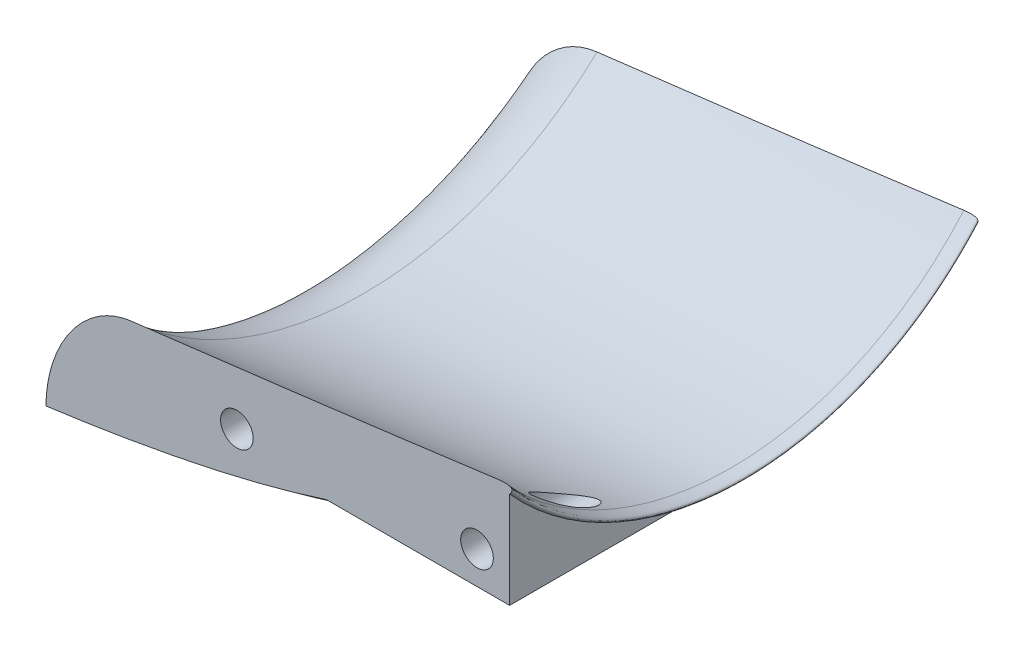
ISO-10303-21;
HEADER;
FILE_DESCRIPTION(('STEP AP214'),'2;1');
FILE_NAME('part.step','',(''),(''),'','','');
FILE_SCHEMA(('AUTOMOTIVE_DESIGN { 1 0 10303 214 1 1 1 1 }'));
ENDSEC;
DATA;
#1=APPLICATION_CONTEXT('core data for automotive mechanical design processes');
#2=APPLICATION_PROTOCOL_DEFINITION('international standard','automotive_design',2000,#1);
#3=PRODUCT_CONTEXT('',#1,'mechanical');
#4=PRODUCT('Part','Part','',(#3));
#5=PRODUCT_RELATED_PRODUCT_CATEGORY('part','',(#4));
#6=PRODUCT_DEFINITION_FORMATION('','',#4);
#7=PRODUCT_DEFINITION_CONTEXT('part definition',#1,'design');
#8=PRODUCT_DEFINITION('design','',#6,#7);
#9=PRODUCT_DEFINITION_SHAPE('','',#8);
#10=(LENGTH_UNIT() NAMED_UNIT(*) SI_UNIT(.MILLI.,.METRE.));
#11=(NAMED_UNIT(*) PLANE_ANGLE_UNIT() SI_UNIT($,.RADIAN.));
#12=(NAMED_UNIT(*) SI_UNIT($,.STERADIAN.) SOLID_ANGLE_UNIT());
#13=UNCERTAINTY_MEASURE_WITH_UNIT(LENGTH_MEASURE(1.E-05),#10,'distance_accuracy_value','');
#14=(GEOMETRIC_REPRESENTATION_CONTEXT(3) GLOBAL_UNCERTAINTY_ASSIGNED_CONTEXT((#13)) GLOBAL_UNIT_ASSIGNED_CONTEXT((#10,
#11,#12)) REPRESENTATION_CONTEXT('',''));
#15=CARTESIAN_POINT('',(0.,0.,0.));
#16=DIRECTION('',(0.,0.,1.));
#17=DIRECTION('',(1.,0.,0.));
#18=AXIS2_PLACEMENT_3D('',#15,#16,#17);
#19=CARTESIAN_POINT('',(0.,0.,0.));
#20=DIRECTION('',(-1.,0.,0.));
#21=DIRECTION('',(0.,0.,1.));
#22=AXIS2_PLACEMENT_3D('',#19,#20,#21);
#23=CONICAL_SURFACE('',#22,40.,0.0872664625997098);
#24=CARTESIAN_POINT('',(77.5638559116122,-30.8708141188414,12.2541999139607));
#25=CARTESIAN_POINT('',(77.4918545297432,-30.8624985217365,12.2922209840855));
#26=CARTESIAN_POINT('',(77.4248429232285,-30.8502434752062,12.3387961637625));
#27=CARTESIAN_POINT('',(77.2997751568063,-30.8207230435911,12.4416149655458));
#28=CARTESIAN_POINT('',(77.2417930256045,-30.8034192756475,12.4979312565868));
#29=CARTESIAN_POINT('',(77.1376205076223,-30.7670071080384,12.6113299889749));
#30=CARTESIAN_POINT('',(77.0908544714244,-30.7481602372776,12.6679769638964));
#31=CARTESIAN_POINT('',(77.0023357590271,-30.7083295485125,12.7843911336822));
#32=CARTESIAN_POINT('',(76.9605883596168,-30.6873435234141,12.8441615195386));
#33=CARTESIAN_POINT('',(76.8812954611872,-30.6437000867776,12.9657545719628));
#34=CARTESIAN_POINT('',(76.8437472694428,-30.6210437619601,13.0275758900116));
#35=CARTESIAN_POINT('',(76.7721803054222,-30.5743135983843,13.1527246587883));
#36=CARTESIAN_POINT('',(76.7381628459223,-30.5502392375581,13.2160526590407));
#37=CARTESIAN_POINT('',(76.6681218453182,-30.4969969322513,13.3537972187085));
#38=CARTESIAN_POINT('',(76.6326183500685,-30.4676217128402,13.4283972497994));
#39=CARTESIAN_POINT('',(76.5652222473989,-30.4074170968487,13.5786418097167));
#40=CARTESIAN_POINT('',(76.5333304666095,-30.3765873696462,13.6542865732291));
#41=CARTESIAN_POINT('',(76.4424646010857,-30.28206833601,13.8824634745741));
#42=CARTESIAN_POINT('',(76.3883554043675,-30.21639267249,14.0361258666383));
#43=CARTESIAN_POINT('',(76.2912844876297,-30.0802446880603,14.3453232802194));
#44=CARTESIAN_POINT('',(76.2483540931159,-30.0097595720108,14.5008623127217));
#45=CARTESIAN_POINT('',(76.1731324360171,-29.8645030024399,14.8125240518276));
#46=CARTESIAN_POINT('',(76.14084227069,-29.7897311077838,14.9686468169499));
#47=CARTESIAN_POINT('',(76.0836918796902,-29.6272226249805,15.2989211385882));
#48=CARTESIAN_POINT('',(76.0601338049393,-29.5389899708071,15.4730561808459));
#49=CARTESIAN_POINT('',(76.0268626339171,-29.3577801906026,15.8203142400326));
#50=CARTESIAN_POINT('',(76.0171574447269,-29.2648003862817,15.9934366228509));
#51=CARTESIAN_POINT('',(76.0131031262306,-29.0747453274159,16.3371078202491));
#52=CARTESIAN_POINT('',(76.0187132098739,-28.9776816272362,16.5076622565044));
#53=CARTESIAN_POINT('',(76.040438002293,-28.8294024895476,16.7606420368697));
#54=CARTESIAN_POINT('',(76.0498920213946,-28.7795474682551,16.8444633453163));
#55=CARTESIAN_POINT('',(76.0736777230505,-28.6790503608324,17.0109247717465));
#56=CARTESIAN_POINT('',(76.0880082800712,-28.6284084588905,17.0935651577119));
#57=CARTESIAN_POINT('',(76.1217899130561,-28.5273740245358,17.2559344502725));
#58=CARTESIAN_POINT('',(76.1411487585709,-28.4769921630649,17.3356889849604));
#59=CARTESIAN_POINT('',(76.1857290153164,-28.3758716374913,17.493285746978));
#60=CARTESIAN_POINT('',(76.2109480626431,-28.3251331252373,17.5711287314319));
#61=CARTESIAN_POINT('',(76.2679659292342,-28.2237737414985,17.7241006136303));
#62=CARTESIAN_POINT('',(76.2997443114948,-28.1731529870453,17.799237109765));
#63=CARTESIAN_POINT('',(76.3708932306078,-28.072419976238,17.9461350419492));
#64=CARTESIAN_POINT('',(76.4102573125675,-28.0223073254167,18.0178992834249));
#65=CARTESIAN_POINT('',(76.496310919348,-27.9250348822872,18.1544693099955));
#66=CARTESIAN_POINT('',(76.5427040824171,-27.8778327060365,18.219429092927));
#67=CARTESIAN_POINT('',(76.6450224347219,-27.7857226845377,18.3433521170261));
#68=CARTESIAN_POINT('',(76.7009461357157,-27.7408144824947,18.4023162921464));
#69=CARTESIAN_POINT('',(76.8140873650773,-27.6617434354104,18.5031268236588));
#70=CARTESIAN_POINT('',(76.86977224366,-27.626992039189,18.5462105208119));
#71=CARTESIAN_POINT('',(76.9892518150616,-27.562117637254,18.6238216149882));
#72=CARTESIAN_POINT('',(77.0530310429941,-27.5319860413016,18.6583649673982));
#73=CARTESIAN_POINT('',(77.1719742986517,-27.4849003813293,18.7091526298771));
#74=CARTESIAN_POINT('',(77.2255386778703,-27.4665189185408,18.727798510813));
#75=CARTESIAN_POINT('',(77.3361871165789,-27.4346905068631,18.7572473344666));
#76=CARTESIAN_POINT('',(77.3932680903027,-27.4212393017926,18.7680570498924));
#77=CARTESIAN_POINT('',(77.5097379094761,-27.4000430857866,18.7809715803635));
#78=CARTESIAN_POINT('',(77.5691360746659,-27.3923243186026,18.7830365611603));
#79=CARTESIAN_POINT('',(77.6880454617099,-27.3830449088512,18.7781734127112));
#80=CARTESIAN_POINT('',(77.7475567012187,-27.3814853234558,18.7712437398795));
#81=CARTESIAN_POINT('',(77.8611131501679,-27.3841715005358,18.7497444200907));
#82=CARTESIAN_POINT('',(77.9152666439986,-27.3880580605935,18.7356830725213));
#83=CARTESIAN_POINT('',(78.0209321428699,-27.4004181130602,18.7012081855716));
#84=CARTESIAN_POINT('',(78.0724431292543,-27.4088933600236,18.6807922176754));
#85=CARTESIAN_POINT('',(78.1971987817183,-27.4349356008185,18.6231184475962));
#86=CARTESIAN_POINT('',(78.2684030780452,-27.4549302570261,18.582547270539));
#87=CARTESIAN_POINT('',(78.4028428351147,-27.5013083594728,18.4927715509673));
#88=CARTESIAN_POINT('',(78.466056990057,-27.527708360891,18.4435447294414));
#89=CARTESIAN_POINT('',(78.6192760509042,-27.6016521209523,18.3086002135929));
#90=CARTESIAN_POINT('',(78.7035533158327,-27.6525780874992,18.2182781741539));
#91=CARTESIAN_POINT('',(78.8557306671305,-27.760900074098,18.028361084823));
#92=CARTESIAN_POINT('',(78.9235951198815,-27.8183097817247,17.9287464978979));
#93=CARTESIAN_POINT('',(79.0385939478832,-27.9301188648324,17.7352186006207));
#94=CARTESIAN_POINT('',(79.087205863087,-27.9841223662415,17.6419380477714));
#95=CARTESIAN_POINT('',(79.1750581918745,-28.0939093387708,17.4520173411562));
#96=CARTESIAN_POINT('',(79.2142914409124,-28.1496941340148,17.3553746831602));
#97=CARTESIAN_POINT('',(79.284566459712,-28.2623173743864,17.159521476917));
#98=CARTESIAN_POINT('',(79.3155926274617,-28.3191576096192,17.0603064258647));
#99=CARTESIAN_POINT('',(79.3702603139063,-28.4332576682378,16.8600835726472));
#100=CARTESIAN_POINT('',(79.3938993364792,-28.4905176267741,16.7590751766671));
#101=CARTESIAN_POINT('',(79.4488275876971,-28.6454712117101,16.4839741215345));
#102=CARTESIAN_POINT('',(79.4737446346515,-28.7431852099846,16.3086050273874));
#103=CARTESIAN_POINT('',(79.5066180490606,-28.9373841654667,15.9555378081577));
#104=CARTESIAN_POINT('',(79.5145610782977,-29.0338680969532,15.7778379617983));
#105=CARTESIAN_POINT('',(79.5148951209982,-29.2247783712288,15.4212868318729));
#106=CARTESIAN_POINT('',(79.5072821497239,-29.3192041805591,15.242435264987));
#107=CARTESIAN_POINT('',(79.4771182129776,-29.5053774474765,14.8847102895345));
#108=CARTESIAN_POINT('',(79.4545758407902,-29.5971264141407,14.7058369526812));
#109=CARTESIAN_POINT('',(79.406893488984,-29.7397040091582,14.4239688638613));
#110=CARTESIAN_POINT('',(79.3868084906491,-29.7915556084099,14.3206152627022));
#111=CARTESIAN_POINT('',(79.3412372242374,-29.8941426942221,14.1145531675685));
#112=CARTESIAN_POINT('',(79.3157517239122,-29.9448783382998,14.011844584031));
#113=CARTESIAN_POINT('',(79.2590022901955,-30.0450487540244,13.8076366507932));
#114=CARTESIAN_POINT('',(79.2277493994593,-30.0944858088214,13.7061353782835));
#115=CARTESIAN_POINT('',(79.1587381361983,-30.1920089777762,13.5047460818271));
#116=CARTESIAN_POINT('',(79.1209821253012,-30.2400955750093,13.4048574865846));
#117=CARTESIAN_POINT('',(79.035354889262,-30.3375742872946,13.2015991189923));
#118=CARTESIAN_POINT('',(78.9870150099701,-30.3868734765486,13.0983765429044));
#119=CARTESIAN_POINT('',(78.9064013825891,-30.4591749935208,12.9470342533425));
#120=CARTESIAN_POINT('',(78.87817011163,-30.4830076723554,12.8971546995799));
#121=CARTESIAN_POINT('',(78.8185714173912,-30.5300080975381,12.7989901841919));
#122=CARTESIAN_POINT('',(78.7872049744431,-30.5531760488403,12.7507047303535));
#123=CARTESIAN_POINT('',(78.7101635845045,-30.6059796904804,12.641178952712));
#124=CARTESIAN_POINT('',(78.6631220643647,-30.635312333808,12.5807381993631));
#125=CARTESIAN_POINT('',(78.5609493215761,-30.6918505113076,12.4659424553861));
#126=CARTESIAN_POINT('',(78.5058357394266,-30.7190604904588,12.4115746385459));
#127=CARTESIAN_POINT('',(78.4097037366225,-30.7596551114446,12.3331647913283));
#128=CARTESIAN_POINT('',(78.3719666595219,-30.7741893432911,12.3057360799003));
#129=CARTESIAN_POINT('',(78.2925023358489,-30.8014274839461,12.2562152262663));
#130=CARTESIAN_POINT('',(78.2507810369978,-30.8141340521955,12.2341152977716));
#131=CARTESIAN_POINT('',(78.1721651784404,-30.834674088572,12.2009536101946));
#132=CARTESIAN_POINT('',(78.1359593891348,-30.8429741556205,12.1885709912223));
#133=CARTESIAN_POINT('',(78.0616349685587,-30.8574246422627,12.1696758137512));
#134=CARTESIAN_POINT('',(78.023518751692,-30.8635777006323,12.1631560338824));
#135=CARTESIAN_POINT('',(77.9461997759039,-30.8733846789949,12.1567172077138));
#136=CARTESIAN_POINT('',(77.9069924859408,-30.8770257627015,12.1568318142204));
#137=CARTESIAN_POINT('',(77.8290067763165,-30.8816371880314,12.1637423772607));
#138=CARTESIAN_POINT('',(77.7902286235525,-30.8826059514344,12.1705422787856));
#139=CARTESIAN_POINT('',(77.7194152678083,-30.8821037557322,12.1887007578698));
#140=CARTESIAN_POINT('',(77.6871791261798,-30.8809460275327,12.1993155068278));
#141=CARTESIAN_POINT('',(77.6242962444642,-30.8770213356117,12.2241995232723));
#142=CARTESIAN_POINT('',(77.5936489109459,-30.8742549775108,12.2384674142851));
#143=CARTESIAN_POINT('',(77.5638559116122,-30.8708141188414,12.2541999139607));
#144=B_SPLINE_CURVE_WITH_KNOTS('',3,(#24,#25,#26,#27,#28,#29,#30,#31,#32,#33,#34,#35,#36,#37,
#38,#39,#40,#41,#42,#43,#44,#45,#46,#47,#48,#49,#50,#51,#52,#53,#54,#55,#56,#57,#58,#59,#60,#61,
#62,#63,#64,#65,#66,#67,#68,#69,#70,#71,#72,#73,#74,#75,#76,#77,#78,#79,#80,#81,#82,#83,#84,#85,
#86,#87,#88,#89,#90,#91,#92,#93,#94,#95,#96,#97,#98,#99,#100,#101,#102,#103,#104,#105,#106,#107,
#108,#109,#110,#111,#112,#113,#114,#115,#116,#117,#118,#119,#120,#121,#122,#123,#124,#125,#126,
#127,#128,#129,#130,#131,#132,#133,#134,#135,#136,#137,#138,#139,#140,#141,#142,#143),
.UNSPECIFIED.,.T.,.F.,(4,2,2,2,2,2,2,2,2,2,2,2,2,2,2,2,2,2,2,2,2,2,2,2,2,2,2,2,2,2,2,2,2,2,2,2,
2,2,2,2,2,2,2,2,2,2,2,2,2,2,2,2,2,2,2,2,2,2,2,4),(0.,0.245378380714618,0.492673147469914,
0.71983930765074,0.947242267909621,1.17449856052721,1.40183904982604,1.66478024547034,
1.92778150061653,2.45418056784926,2.98203922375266,3.50995229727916,4.09930766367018,
4.68899929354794,5.27712201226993,5.57096967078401,5.86474955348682,6.15348071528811,
6.44209560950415,6.72982448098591,7.01730958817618,7.29496873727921,7.57258456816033,
7.80734103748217,8.04165555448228,8.21980267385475,8.39779563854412,8.57659853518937,
8.75543212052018,8.92301017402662,9.0906523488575,9.3422812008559,9.59456747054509,
9.99318538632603,10.392661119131,10.7468769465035,11.101362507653,11.4565171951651,
11.8117917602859,12.417761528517,13.0242072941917,13.630808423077,14.2370606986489,
14.5890388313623,14.9409669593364,15.292228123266,15.6433619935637,16.0154173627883,
16.2015537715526,16.3876321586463,16.6332628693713,16.8783645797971,17.024603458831,
17.1706273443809,17.2876286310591,17.4044856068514,17.5219353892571,17.6394545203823,
17.7410263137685,17.8425598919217),.UNSPECIFIED.);
#145=CARTESIAN_POINT('',(77.5638559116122,-30.8708141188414,12.2541999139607));
#146=VERTEX_POINT('',#145);
#147=EDGE_CURVE('E215',#146,#146,#144,.T.);
#148=ORIENTED_EDGE('',*,*,#147,.F.);
#149=EDGE_LOOP('',(#148));
#150=FACE_BOUND('',#149,.T.);
#151=CARTESIAN_POINT('',(-22.9959396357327,-33.7638623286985,25.));
#152=CARTESIAN_POINT('',(-20.2365086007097,-33.4634646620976,25.));
#153=CARTESIAN_POINT('',(-17.4772295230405,-33.1616717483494,25.));
#154=CARTESIAN_POINT('',(-11.9590052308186,-32.5550403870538,25.));
#155=CARTESIAN_POINT('',(-9.20006001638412,-32.2502019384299,25.));
#156=CARTESIAN_POINT('',(-0.92374426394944,-31.3307328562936,25.));
#157=CARTESIAN_POINT('',(4.59307762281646,-30.7111516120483,25.));
#158=CARTESIAN_POINT('',(15.6276129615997,-29.4559212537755,25.));
#159=CARTESIAN_POINT('',(21.1453255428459,-28.8202644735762,25.));
#160=CARTESIAN_POINT('',(32.178501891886,-27.5297799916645,25.));
#161=CARTESIAN_POINT('',(37.6939656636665,-26.8749523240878,25.));
#162=CARTESIAN_POINT('',(48.7219723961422,-25.5415859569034,25.));
#163=CARTESIAN_POINT('',(54.2345153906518,-24.8630475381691,25.));
#164=CARTESIAN_POINT('',(62.500490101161,-23.8225736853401,25.));
#165=CARTESIAN_POINT('',(65.2553491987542,-23.47197037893,25.));
#166=CARTESIAN_POINT('',(70.7639528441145,-22.7621078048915,25.));
#167=CARTESIAN_POINT('',(73.5176973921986,-22.402848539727,25.));
#168=CARTESIAN_POINT('',(79.0230878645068,-21.6744749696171,25.));
#169=CARTESIAN_POINT('',(81.7747341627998,-21.3053634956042,25.));
#170=CARTESIAN_POINT('',(87.276446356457,-20.5555494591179,25.));
#171=CARTESIAN_POINT('',(90.0265122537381,-20.1748469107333,25.));
#172=CARTESIAN_POINT('',(95.5247230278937,-19.3997661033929,25.));
#173=CARTESIAN_POINT('',(98.2728679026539,-19.00538782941,25.));
#174=CARTESIAN_POINT('',(103.766752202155,-18.2002434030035,25.));
#175=CARTESIAN_POINT('',(106.512491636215,-17.7894773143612,25.));
#176=CARTESIAN_POINT('',(112.00146855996,-16.9478152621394,25.));
#177=CARTESIAN_POINT('',(114.744705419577,-16.5169151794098,25.));
#178=CARTESIAN_POINT('',(120.227057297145,-15.630041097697,25.));
#179=CARTESIAN_POINT('',(122.966172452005,-15.1740679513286,25.));
#180=CARTESIAN_POINT('',(127.0710254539,-14.4655804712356,25.));
#181=CARTESIAN_POINT('',(128.438874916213,-14.225292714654,25.));
#182=CARTESIAN_POINT('',(131.172864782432,-13.7352281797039,25.));
#183=CARTESIAN_POINT('',(132.539005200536,-13.4854514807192,25.));
#184=CARTESIAN_POINT('',(135.269355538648,-12.9747596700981,25.));
#185=CARTESIAN_POINT('',(136.633565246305,-12.7138434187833,25.));
#186=CARTESIAN_POINT('',(138.677944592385,-12.312515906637,25.));
#187=CARTESIAN_POINT('',(139.35909179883,-12.1770791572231,25.));
#188=CARTESIAN_POINT('',(140.72065048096,-11.9025378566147,25.));
#189=CARTESIAN_POINT('',(141.401061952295,-11.763433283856,25.));
#190=CARTESIAN_POINT('',(142.081059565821,-11.6223199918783,25.));
#191=B_SPLINE_CURVE_WITH_KNOTS('',3,(#151,#152,#153,#154,#155,#156,#157,#158,#159,#160,#161,
#162,#163,#164,#165,#166,#167,#168,#169,#170,#171,#172,#173,#174,#175,#176,#177,#178,#179,#180,
#181,#182,#183,#184,#185,#186,#187,#188,#189,#190),.UNSPECIFIED.,.F.,.F.,(4,2,2,2,2,2,2,2,2,2,2,
2,2,2,2,2,2,2,2,4),(0.,8.32720089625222,16.6544047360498,33.3088992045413,49.9714915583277,
66.6340542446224,83.2964196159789,91.6276476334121,99.95887327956,108.287730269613,
116.616577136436,124.945433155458,133.274256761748,141.604791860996,149.935043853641,
154.101400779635,158.267722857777,162.434472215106,164.517907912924,166.601355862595),.UNSPECIFIED.);
#192=CARTESIAN_POINT('',(79.9999999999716,-21.5420485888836,25.));
#193=VERTEX_POINT('',#192);
#194=CARTESIAN_POINT('',(40.6470926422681,-26.5170414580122,25.));
#195=VERTEX_POINT('',#194);
#196=EDGE_CURVE('E143',#193,#195,#191,.F.);
#197=ORIENTED_EDGE('',*,*,#196,.F.);
#198=CARTESIAN_POINT('',(80.,0.,0.));
#199=DIRECTION('',(-1.,0.,0.));
#200=DIRECTION('',(0.,0.,-1.));
#201=AXIS2_PLACEMENT_3D('',#198,#199,#200);
#202=CIRCLE('',#201,33.0009069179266);
#203=CARTESIAN_POINT('',(80.,-21.5420485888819,-24.9999999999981));
#204=VERTEX_POINT('',#203);
#205=EDGE_CURVE('E104',#204,#193,#202,.T.);
#206=ORIENTED_EDGE('',*,*,#205,.F.);
#207=CARTESIAN_POINT('',(-22.9959396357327,-33.7638623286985,-25.));
#208=CARTESIAN_POINT('',(-20.2365086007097,-33.4634646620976,-25.));
#209=CARTESIAN_POINT('',(-17.4772295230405,-33.1616717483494,-25.));
#210=CARTESIAN_POINT('',(-11.9590052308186,-32.5550403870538,-25.));
#211=CARTESIAN_POINT('',(-9.20006001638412,-32.2502019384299,-25.));
#212=CARTESIAN_POINT('',(-0.92374426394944,-31.3307328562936,-25.));
#213=CARTESIAN_POINT('',(4.59307762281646,-30.7111516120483,-25.));
#214=CARTESIAN_POINT('',(15.6276129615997,-29.4559212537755,-25.));
#215=CARTESIAN_POINT('',(21.1453255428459,-28.8202644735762,-25.));
#216=CARTESIAN_POINT('',(32.178501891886,-27.5297799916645,-25.));
#217=CARTESIAN_POINT('',(37.6939656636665,-26.8749523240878,-25.));
#218=CARTESIAN_POINT('',(48.7219723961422,-25.5415859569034,-25.));
#219=CARTESIAN_POINT('',(54.2345153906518,-24.8630475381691,-25.));
#220=CARTESIAN_POINT('',(62.500490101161,-23.8225736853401,-25.));
#221=CARTESIAN_POINT('',(65.2553491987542,-23.47197037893,-25.));
#222=CARTESIAN_POINT('',(70.7639528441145,-22.7621078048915,-25.));
#223=CARTESIAN_POINT('',(73.5176973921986,-22.402848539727,-25.));
#224=CARTESIAN_POINT('',(79.0230878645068,-21.6744749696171,-25.));
#225=CARTESIAN_POINT('',(81.7747341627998,-21.3053634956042,-25.));
#226=CARTESIAN_POINT('',(87.276446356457,-20.5555494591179,-25.));
#227=CARTESIAN_POINT('',(90.0265122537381,-20.1748469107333,-25.));
#228=CARTESIAN_POINT('',(95.5247230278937,-19.3997661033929,-25.));
#229=CARTESIAN_POINT('',(98.2728679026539,-19.00538782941,-25.));
#230=CARTESIAN_POINT('',(103.766752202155,-18.2002434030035,-25.));
#231=CARTESIAN_POINT('',(106.512491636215,-17.7894773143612,-25.));
#232=CARTESIAN_POINT('',(112.00146855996,-16.9478152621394,-25.));
#233=CARTESIAN_POINT('',(114.744705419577,-16.5169151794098,-25.));
#234=CARTESIAN_POINT('',(120.227057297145,-15.630041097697,-25.));
#235=CARTESIAN_POINT('',(122.966172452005,-15.1740679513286,-25.));
#236=CARTESIAN_POINT('',(127.0710254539,-14.4655804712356,-25.));
#237=CARTESIAN_POINT('',(128.438874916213,-14.225292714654,-25.));
#238=CARTESIAN_POINT('',(131.172864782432,-13.7352281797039,-25.));
#239=CARTESIAN_POINT('',(132.539005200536,-13.4854514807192,-25.));
#240=CARTESIAN_POINT('',(135.269355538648,-12.9747596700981,-25.));
#241=CARTESIAN_POINT('',(136.633565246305,-12.7138434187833,-25.));
#242=CARTESIAN_POINT('',(138.677944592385,-12.312515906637,-25.));
#243=CARTESIAN_POINT('',(139.35909179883,-12.1770791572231,-25.));
#244=CARTESIAN_POINT('',(140.72065048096,-11.9025378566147,-25.));
#245=CARTESIAN_POINT('',(141.401061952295,-11.763433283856,-25.));
#246=CARTESIAN_POINT('',(142.081059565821,-11.6223199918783,-25.));
#247=B_SPLINE_CURVE_WITH_KNOTS('',3,(#207,#208,#209,#210,#211,#212,#213,#214,#215,#216,#217,
#218,#219,#220,#221,#222,#223,#224,#225,#226,#227,#228,#229,#230,#231,#232,#233,#234,#235,#236,
#237,#238,#239,#240,#241,#242,#243,#244,#245,#246),.UNSPECIFIED.,.F.,.F.,(4,2,2,2,2,2,2,2,2,2,2,
2,2,2,2,2,2,2,2,4),(0.,8.32720089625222,16.6544047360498,33.3088992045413,49.9714915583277,
66.6340542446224,83.2964196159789,91.6276476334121,99.95887327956,108.287730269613,
116.616577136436,124.945433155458,133.274256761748,141.604791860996,149.935043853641,
154.101400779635,158.267722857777,162.434472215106,164.517907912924,166.601355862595),.UNSPECIFIED.);
#248=CARTESIAN_POINT('',(40.6470926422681,-26.5170414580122,-25.));
#249=VERTEX_POINT('',#248);
#250=EDGE_CURVE('E117',#249,#204,#247,.T.);
#251=ORIENTED_EDGE('',*,*,#250,.F.);
#252=CARTESIAN_POINT('',(40.6470926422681,0.,0.));
#253=DIRECTION('',(1.,0.,0.));
#254=DIRECTION('',(0.,0.,1.));
#255=AXIS2_PLACEMENT_3D('',#252,#253,#254);
#256=CIRCLE('',#255,36.4438401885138);
#257=EDGE_CURVE('E106',#195,#249,#256,.T.);
#258=ORIENTED_EDGE('',*,*,#257,.F.);
#259=EDGE_LOOP('',(#197,#206,#251,#258));
#260=FACE_BOUND('',#259,.T.);
#261=ADVANCED_FACE('F34',(#150,#260),#23,.F.);
#262=CARTESIAN_POINT('',(-16.2695424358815,-49.2273731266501,0.));
#263=CARTESIAN_POINT('',(57.7000408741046,-47.5160802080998,0.));
#264=CARTESIAN_POINT('',(82.4369177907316,-32.8053972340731,0.));
#265=CARTESIAN_POINT('',(80.,-33.0009069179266,0.));
#266=B_SPLINE_CURVE_WITH_KNOTS('',2,(#262,#263,#264,#265),.UNSPECIFIED.,.F.,.F.,(3,1,3),(0.,
0.940488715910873,1.),.UNSPECIFIED.);
#267=CARTESIAN_POINT('',(122.454525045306,0.,0.));
#268=DIRECTION('',(1.,0.,0.));
#269=AXIS1_PLACEMENT('',#267,#268);
#270=SURFACE_OF_REVOLUTION('',#266,#269);
#271=CARTESIAN_POINT('',(80.,-21.5420485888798,25.));
#272=CARTESIAN_POINT('',(80.0426055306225,-21.5368157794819,25.));
#273=CARTESIAN_POINT('',(80.0852436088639,-21.5318369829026,25.));
#274=CARTESIAN_POINT('',(80.1706365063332,-21.5224756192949,25.));
#275=CARTESIAN_POINT('',(80.213391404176,-21.5180937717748,25.));
#276=CARTESIAN_POINT('',(80.2989880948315,-21.5100255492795,25.));
#277=CARTESIAN_POINT('',(80.3418299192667,-21.5063395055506,25.));
#278=CARTESIAN_POINT('',(80.428442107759,-21.4997284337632,25.));
#279=CARTESIAN_POINT('',(80.4722137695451,-21.4968202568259,25.));
#280=CARTESIAN_POINT('',(80.5598005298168,-21.4920429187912,25.));
#281=CARTESIAN_POINT('',(80.6036156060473,-21.4901733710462,25.));
#282=CARTESIAN_POINT('',(80.6912645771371,-21.4877279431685,25.));
#283=CARTESIAN_POINT('',(80.7350984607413,-21.4871516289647,25.));
#284=CARTESIAN_POINT('',(80.8443835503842,-21.4877337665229,25.));
#285=CARTESIAN_POINT('',(80.9098445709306,-21.4898868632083,25.));
#286=CARTESIAN_POINT('',(81.0075610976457,-21.4973606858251,25.));
#287=CARTESIAN_POINT('',(81.0399773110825,-21.5005467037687,25.));
#288=CARTESIAN_POINT('',(81.1045662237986,-21.508785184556,25.));
#289=CARTESIAN_POINT('',(81.136739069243,-21.5138364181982,25.));
#290=CARTESIAN_POINT('',(81.1911062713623,-21.5246201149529,25.));
#291=CARTESIAN_POINT('',(81.2134271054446,-21.5297050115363,25.));
#292=CARTESIAN_POINT('',(81.2576868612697,-21.5415304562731,25.));
#293=CARTESIAN_POINT('',(81.2796249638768,-21.5482741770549,25.));
#294=CARTESIAN_POINT('',(81.3229259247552,-21.5640168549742,25.));
#295=CARTESIAN_POINT('',(81.3442816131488,-21.5730360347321,25.));
#296=CARTESIAN_POINT('',(81.3854682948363,-21.5940882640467,25.));
#297=CARTESIAN_POINT('',(81.405304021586,-21.6061114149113,25.));
#298=CARTESIAN_POINT('',(81.4342001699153,-21.6281441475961,25.));
#299=CARTESIAN_POINT('',(81.4442552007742,-21.6368350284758,25.));
#300=CARTESIAN_POINT('',(81.4629326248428,-21.6556260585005,25.));
#301=CARTESIAN_POINT('',(81.4715583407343,-21.6657228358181,25.));
#302=CARTESIAN_POINT('',(81.4869855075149,-21.6874087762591,25.));
#303=CARTESIAN_POINT('',(81.4937665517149,-21.6990126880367,25.));
#304=CARTESIAN_POINT('',(81.504967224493,-21.723310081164,25.));
#305=CARTESIAN_POINT('',(81.5093876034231,-21.736003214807,25.));
#306=CARTESIAN_POINT('',(81.5154405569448,-21.7605674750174,25.));
#307=CARTESIAN_POINT('',(81.5173229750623,-21.7723789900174,25.));
#308=CARTESIAN_POINT('',(81.5193188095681,-21.7961606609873,25.));
#309=CARTESIAN_POINT('',(81.5194287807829,-21.808131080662,25.));
#310=CARTESIAN_POINT('',(81.5177314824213,-21.8395834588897,25.));
#311=CARTESIAN_POINT('',(81.5146582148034,-21.85899269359,25.));
#312=CARTESIAN_POINT('',(81.5056519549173,-21.897130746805,25.));
#313=CARTESIAN_POINT('',(81.4997099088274,-21.9158572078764,25.));
#314=CARTESIAN_POINT('',(81.4840711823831,-21.9571949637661,25.));
#315=CARTESIAN_POINT('',(81.4738042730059,-21.9795855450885,25.));
#316=CARTESIAN_POINT('',(81.451212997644,-22.0232470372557,25.));
#317=CARTESIAN_POINT('',(81.4388899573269,-22.0445186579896,25.));
#318=CARTESIAN_POINT('',(81.4127092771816,-22.086279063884,25.));
#319=CARTESIAN_POINT('',(81.3988421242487,-22.1067618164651,25.));
#320=CARTESIAN_POINT('',(81.3700373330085,-22.1469399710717,25.));
#321=CARTESIAN_POINT('',(81.3551000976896,-22.1666356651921,25.));
#322=CARTESIAN_POINT('',(81.31919597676,-22.2119508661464,25.));
#323=CARTESIAN_POINT('',(81.2979036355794,-22.2373114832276,25.));
#324=CARTESIAN_POINT('',(81.254243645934,-22.2870910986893,25.));
#325=CARTESIAN_POINT('',(81.2318757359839,-22.3115098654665,25.));
#326=CARTESIAN_POINT('',(81.1862694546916,-22.3596187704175,25.));
#327=CARTESIAN_POINT('',(81.1630292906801,-22.3833072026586,25.));
#328=CARTESIAN_POINT('',(81.1158978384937,-22.4300153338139,25.));
#329=CARTESIAN_POINT('',(81.0920066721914,-22.4530351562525,25.));
#330=CARTESIAN_POINT('',(81.0436594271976,-22.4985648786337,25.));
#331=CARTESIAN_POINT('',(81.0192023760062,-22.5210737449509,25.));
#332=CARTESIAN_POINT('',(80.9821528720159,-22.5544331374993,25.));
#333=CARTESIAN_POINT('',(80.9697418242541,-22.5654860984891,25.));
#334=CARTESIAN_POINT('',(80.9448844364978,-22.5875524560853,25.));
#335=CARTESIAN_POINT('',(80.9324380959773,-22.5985658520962,25.));
#336=CARTESIAN_POINT('',(80.8950544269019,-22.6316014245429,25.));
#337=CARTESIAN_POINT('',(80.8700951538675,-22.6535988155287,25.));
#338=CARTESIAN_POINT('',(80.8201030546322,-22.6975093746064,25.));
#339=CARTESIAN_POINT('',(80.7950702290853,-22.7194225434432,25.));
#340=CARTESIAN_POINT('',(80.7199538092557,-22.7849679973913,25.));
#341=CARTESIAN_POINT('',(80.6697667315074,-22.8284818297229,25.));
#342=CARTESIAN_POINT('',(80.5691531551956,-22.915161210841,25.));
#343=CARTESIAN_POINT('',(80.5187268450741,-22.9583269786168,25.));
#344=CARTESIAN_POINT('',(80.3176677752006,-23.1293530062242,25.));
#345=CARTESIAN_POINT('',(80.1659784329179,-23.2559752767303,25.));
#346=CARTESIAN_POINT('',(79.8602415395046,-23.5065544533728,25.));
#347=CARTESIAN_POINT('',(79.7061924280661,-23.6305094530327,25.));
#348=CARTESIAN_POINT('',(79.3958976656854,-23.8757616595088,25.));
#349=CARTESIAN_POINT('',(79.239651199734,-23.9970578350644,25.));
#350=CARTESIAN_POINT('',(78.9251278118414,-24.2370008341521,25.));
#351=CARTESIAN_POINT('',(78.7668508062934,-24.3556475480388,25.));
#352=CARTESIAN_POINT('',(78.4490676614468,-24.5898365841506,25.));
#353=CARTESIAN_POINT('',(78.2895697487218,-24.7053900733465,25.));
#354=CARTESIAN_POINT('',(77.9688083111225,-24.9339553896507,25.));
#355=CARTESIAN_POINT('',(77.8075451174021,-25.0469676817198,25.));
#356=CARTESIAN_POINT('',(77.4833361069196,-25.2705205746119,25.));
#357=CARTESIAN_POINT('',(77.3203904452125,-25.3810614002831,25.));
#358=CARTESIAN_POINT('',(76.9929005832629,-25.5997360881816,25.));
#359=CARTESIAN_POINT('',(76.8283564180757,-25.7078700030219,25.));
#360=CARTESIAN_POINT('',(76.1592443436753,-26.1408340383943,25.));
#361=CARTESIAN_POINT('',(75.6483639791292,-26.4559738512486,25.));
#362=CARTESIAN_POINT('',(74.614494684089,-27.0662964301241,25.));
#363=CARTESIAN_POINT('',(74.0914989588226,-27.3614676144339,25.));
#364=CARTESIAN_POINT('',(73.03512038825,-27.9334823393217,25.));
#365=CARTESIAN_POINT('',(72.5017304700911,-28.2103127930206,25.));
#366=CARTESIAN_POINT('',(71.4262219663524,-28.7470413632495,25.));
#367=CARTESIAN_POINT('',(70.8840995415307,-29.0069317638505,25.));
#368=CARTESIAN_POINT('',(69.792685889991,-29.5110109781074,25.));
#369=CARTESIAN_POINT('',(69.2433953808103,-29.7552013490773,25.));
#370=CARTESIAN_POINT('',(68.131605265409,-30.2321979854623,25.));
#371=CARTESIAN_POINT('',(67.569026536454,-30.4648194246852,25.));
#372=CARTESIAN_POINT('',(66.4387483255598,-30.9163614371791,25.));
#373=CARTESIAN_POINT('',(65.8710516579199,-31.1352890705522,25.));
#374=CARTESIAN_POINT('',(64.7311441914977,-31.560594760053,25.));
#375=CARTESIAN_POINT('',(64.1589345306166,-31.7669758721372,25.));
#376=CARTESIAN_POINT('',(63.0105534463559,-32.1681895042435,25.));
#377=CARTESIAN_POINT('',(62.4343824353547,-32.3630232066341,25.));
#378=CARTESIAN_POINT('',(61.2785888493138,-32.7420161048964,25.));
#379=CARTESIAN_POINT('',(60.6989664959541,-32.9261759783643,25.));
#380=CARTESIAN_POINT('',(59.327619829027,-33.3490895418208,25.));
#381=CARTESIAN_POINT('',(58.5346016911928,-33.5836512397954,25.));
#382=CARTESIAN_POINT('',(56.9438316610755,-34.0362520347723,25.));
#383=CARTESIAN_POINT('',(56.146079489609,-34.2542901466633,25.));
#384=CARTESIAN_POINT('',(54.5464411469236,-34.6753767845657,25.));
#385=CARTESIAN_POINT('',(53.7445540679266,-34.8784218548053,25.));
#386=CARTESIAN_POINT('',(52.1372013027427,-35.270833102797,25.));
#387=CARTESIAN_POINT('',(51.3317346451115,-35.4601952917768,25.));
#388=CARTESIAN_POINT('',(49.7177325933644,-35.8263723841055,25.));
#389=CARTESIAN_POINT('',(48.9091964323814,-36.0031839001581,25.));
#390=CARTESIAN_POINT('',(47.2895303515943,-36.345245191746,25.));
#391=CARTESIAN_POINT('',(46.4783999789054,-36.5104928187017,25.));
#392=CARTESIAN_POINT('',(44.8839796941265,-36.824386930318,25.));
#393=CARTESIAN_POINT('',(44.1007658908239,-36.973420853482,25.));
#394=CARTESIAN_POINT('',(42.5327243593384,-37.2622503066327,25.));
#395=CARTESIAN_POINT('',(41.7478968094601,-37.4020468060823,25.));
#396=CARTESIAN_POINT('',(40.1770164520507,-37.6730080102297,25.));
#397=CARTESIAN_POINT('',(39.3909641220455,-37.8041754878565,25.));
#398=CARTESIAN_POINT('',(37.818012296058,-38.0584225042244,25.));
#399=CARTESIAN_POINT('',(37.031113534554,-38.1815065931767,25.));
#400=CARTESIAN_POINT('',(35.4568399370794,-38.4200809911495,25.));
#401=CARTESIAN_POINT('',(34.6694660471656,-38.5355775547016,25.));
#402=CARTESIAN_POINT('',(33.0946011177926,-38.7594141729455,25.));
#403=CARTESIAN_POINT('',(32.3071111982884,-38.867762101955,25.));
#404=CARTESIAN_POINT('',(31.5191879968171,-38.972826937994,25.));
#405=B_SPLINE_CURVE_WITH_KNOTS('',3,(#271,#272,#273,#274,#275,#276,#277,#278,#279,#280,#281,
#282,#283,#284,#285,#286,#287,#288,#289,#290,#291,#292,#293,#294,#295,#296,#297,#298,#299,#300,
#301,#302,#303,#304,#305,#306,#307,#308,#309,#310,#311,#312,#313,#314,#315,#316,#317,#318,#319,
#320,#321,#322,#323,#324,#325,#326,#327,#328,#329,#330,#331,#332,#333,#334,#335,#336,#337,#338,
#339,#340,#341,#342,#343,#344,#345,#346,#347,#348,#349,#350,#351,#352,#353,#354,#355,#356,#357,
#358,#359,#360,#361,#362,#363,#364,#365,#366,#367,#368,#369,#370,#371,#372,#373,#374,#375,#376,
#377,#378,#379,#380,#381,#382,#383,#384,#385,#386,#387,#388,#389,#390,#391,#392,#393,#394,#395,
#396,#397,#398,#399,#400,#401,#402,#403,#404),.UNSPECIFIED.,.F.,.F.,(4,2,2,2,2,2,2,2,2,2,2,2,2,
2,2,2,2,2,2,2,2,2,2,2,2,2,2,2,2,2,2,2,2,2,2,2,2,2,2,2,2,2,2,2,2,2,2,2,2,2,2,2,2,2,2,2,2,2,2,2,2,
2,2,2,2,2,4),(0.,0.128778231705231,0.257710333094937,0.386703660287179,0.518299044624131,
0.649845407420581,0.781347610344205,0.977642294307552,1.07532452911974,1.17294250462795,
1.24157650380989,1.31034280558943,1.37974321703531,1.44891788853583,1.48866984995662,
1.52832806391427,1.56840863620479,1.60847646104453,1.6442099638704,1.68001291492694,
1.73862395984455,1.79742120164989,1.87114567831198,1.94482280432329,2.01898198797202,
2.09311338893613,2.19241134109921,2.29173355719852,2.39127247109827,2.49079287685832,
2.59049931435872,2.6403569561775,2.69021534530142,2.7900232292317,2.88983022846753,
3.08910175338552,3.28823620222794,3.88097686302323,4.47412799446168,5.06750525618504,
5.66090702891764,6.25175379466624,6.84249155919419,7.43317535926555,8.02384623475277,
9.82404817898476,11.6252854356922,13.4277944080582,15.231118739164,17.0342639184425,
18.8603974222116,20.6855815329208,22.5103192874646,24.3348698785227,26.1593045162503,
28.6400358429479,31.1209149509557,33.6023641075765,36.0845337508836,38.5673707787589,
41.0506679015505,43.4424106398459,45.8339019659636,48.2246209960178,50.6139825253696,
53.0013490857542,55.3860404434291),.UNSPECIFIED.);
#406=CARTESIAN_POINT('',(61.6118663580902,-32.6323811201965,25.));
#407=VERTEX_POINT('',#406);
#408=CARTESIAN_POINT('',(31.5191879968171,-38.972826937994,25.));
#409=VERTEX_POINT('',#408);
#410=EDGE_CURVE('E107',#407,#409,#405,.T.);
#411=ORIENTED_EDGE('',*,*,#410,.T.);
#412=CARTESIAN_POINT('',(31.5191879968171,0.,0.));
#413=DIRECTION('',(-1.,0.,0.));
#414=DIRECTION('',(0.,0.,-1.));
#415=AXIS2_PLACEMENT_3D('',#412,#413,#414);
#416=CIRCLE('',#415,46.3020651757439);
#417=CARTESIAN_POINT('',(31.5191879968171,-38.9728269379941,-25.));
#418=VERTEX_POINT('',#417);
#419=EDGE_CURVE('E110',#409,#418,#416,.F.);
#420=ORIENTED_EDGE('',*,*,#419,.T.);
#421=CARTESIAN_POINT('',(31.5191879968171,-38.972826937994,-25.));
#422=CARTESIAN_POINT('',(32.6336444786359,-38.8241978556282,-25.));
#423=CARTESIAN_POINT('',(33.747248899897,-38.6690335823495,-25.));
#424=CARTESIAN_POINT('',(35.9807353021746,-38.3430692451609,-25.));
#425=CARTESIAN_POINT('',(37.1006013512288,-38.1721601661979,-25.));
#426=CARTESIAN_POINT('',(39.344173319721,-37.8133174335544,-25.));
#427=CARTESIAN_POINT('',(40.467864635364,-37.6252921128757,-25.));
#428=CARTESIAN_POINT('',(42.7165958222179,-37.2305936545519,-25.));
#429=CARTESIAN_POINT('',(43.8416232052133,-37.0238491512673,-25.));
#430=CARTESIAN_POINT('',(46.0905019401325,-36.5898719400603,-25.));
#431=CARTESIAN_POINT('',(47.2143441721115,-36.3625917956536,-25.));
#432=CARTESIAN_POINT('',(49.4582727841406,-35.8854084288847,-25.));
#433=CARTESIAN_POINT('',(50.5783549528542,-35.635485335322,-25.));
#434=CARTESIAN_POINT('',(52.8635096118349,-35.0984386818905,-25.));
#435=CARTESIAN_POINT('',(54.028307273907,-34.8101391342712,-25.));
#436=CARTESIAN_POINT('',(56.3483094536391,-34.2024769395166,-25.));
#437=CARTESIAN_POINT('',(57.5035238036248,-33.8831519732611,-25.));
#438=CARTESIAN_POINT('',(59.8012978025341,-33.2091254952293,-25.));
#439=CARTESIAN_POINT('',(60.9438773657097,-32.8544925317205,-25.));
#440=CARTESIAN_POINT('',(62.6461852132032,-32.2917714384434,-25.));
#441=CARTESIAN_POINT('',(63.2110948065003,-32.0992919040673,-25.));
#442=CARTESIAN_POINT('',(64.3369684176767,-31.7031385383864,-25.));
#443=CARTESIAN_POINT('',(64.8979325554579,-31.4994650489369,-25.));
#444=CARTESIAN_POINT('',(66.0143223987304,-31.0803811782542,-25.));
#445=CARTESIAN_POINT('',(66.5697562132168,-30.864992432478,-25.));
#446=CARTESIAN_POINT('',(67.6753575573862,-30.4211395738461,-25.));
#447=CARTESIAN_POINT('',(68.2255253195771,-30.192676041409,-25.));
#448=CARTESIAN_POINT('',(69.3195787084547,-29.7216188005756,-25.));
#449=CARTESIAN_POINT('',(69.8634663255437,-29.4790297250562,-25.));
#450=CARTESIAN_POINT('',(70.9440722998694,-28.9784321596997,-25.));
#451=CARTESIAN_POINT('',(71.480791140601,-28.7204247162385,-25.));
#452=CARTESIAN_POINT('',(72.5276511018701,-28.19672373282,-25.));
#453=CARTESIAN_POINT('',(73.0380737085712,-27.9315940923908,-25.));
#454=CARTESIAN_POINT('',(74.0499203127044,-27.3842600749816,-25.));
#455=CARTESIAN_POINT('',(74.5513413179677,-27.1020501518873,-25.));
#456=CARTESIAN_POINT('',(75.5435520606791,-26.5191358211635,-25.));
#457=CARTESIAN_POINT('',(76.0343385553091,-26.2184258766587,-25.));
#458=CARTESIAN_POINT('',(77.0005088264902,-25.5988504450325,-25.));
#459=CARTESIAN_POINT('',(77.475962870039,-25.2800947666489,-25.));
#460=CARTESIAN_POINT('',(78.4119808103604,-24.6215372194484,-25.));
#461=CARTESIAN_POINT('',(78.8725482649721,-24.2817404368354,-25.));
#462=CARTESIAN_POINT('',(79.5501492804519,-23.7553575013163,-25.));
#463=CARTESIAN_POINT('',(79.7737431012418,-23.5771709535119,-25.));
#464=CARTESIAN_POINT('',(80.2162220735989,-23.2150511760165,-25.));
#465=CARTESIAN_POINT('',(80.4351075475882,-23.0311183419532,-25.));
#466=CARTESIAN_POINT('',(80.6973975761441,-22.8045315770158,-25.));
#467=CARTESIAN_POINT('',(80.7432470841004,-22.7646903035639,-25.));
#468=CARTESIAN_POINT('',(80.8118583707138,-22.704728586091,-25.));
#469=CARTESIAN_POINT('',(80.834704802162,-22.6847052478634,-25.));
#470=CARTESIAN_POINT('',(80.8803282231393,-22.6445795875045,-25.));
#471=CARTESIAN_POINT('',(80.9031052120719,-22.624477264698,-25.));
#472=CARTESIAN_POINT('',(80.9486736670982,-22.5842222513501,-25.));
#473=CARTESIAN_POINT('',(80.9714651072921,-22.5640695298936,-25.));
#474=CARTESIAN_POINT('',(81.0166689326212,-22.5233425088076,-25.));
#475=CARTESIAN_POINT('',(81.0390813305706,-22.502768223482,-25.));
#476=CARTESIAN_POINT('',(81.0834587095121,-22.4611630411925,-25.));
#477=CARTESIAN_POINT('',(81.1054238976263,-22.4401323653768,-25.));
#478=CARTESIAN_POINT('',(81.1488249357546,-22.3975307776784,-25.));
#479=CARTESIAN_POINT('',(81.1702607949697,-22.3759598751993,-25.));
#480=CARTESIAN_POINT('',(81.2125996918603,-22.3320656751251,-25.));
#481=CARTESIAN_POINT('',(81.233499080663,-22.3097388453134,-25.));
#482=CARTESIAN_POINT('',(81.2744682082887,-22.264323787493,-25.));
#483=CARTESIAN_POINT('',(81.294537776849,-22.2412354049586,-25.));
#484=CARTESIAN_POINT('',(81.333512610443,-22.1942272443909,-25.));
#485=CARTESIAN_POINT('',(81.3524217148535,-22.1703106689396,-25.));
#486=CARTESIAN_POINT('',(81.3887568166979,-22.1213574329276,-25.));
#487=CARTESIAN_POINT('',(81.4061828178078,-22.0963207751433,-25.));
#488=CARTESIAN_POINT('',(81.4341312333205,-22.0523122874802,-25.));
#489=CARTESIAN_POINT('',(81.4451912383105,-22.0336843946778,-25.));
#490=CARTESIAN_POINT('',(81.4658070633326,-21.9956214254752,-25.));
#491=CARTESIAN_POINT('',(81.4753643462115,-21.9761871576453,-25.));
#492=CARTESIAN_POINT('',(81.492466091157,-21.9361657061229,-25.));
#493=CARTESIAN_POINT('',(81.4999861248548,-21.9155678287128,-25.));
#494=CARTESIAN_POINT('',(81.5118074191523,-21.8734569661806,-25.));
#495=CARTESIAN_POINT('',(81.5161197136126,-21.8519473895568,-25.));
#496=CARTESIAN_POINT('',(81.519206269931,-21.8173118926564,-25.));
#497=CARTESIAN_POINT('',(81.5195188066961,-21.8043306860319,-25.));
#498=CARTESIAN_POINT('',(81.5181090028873,-21.7784890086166,-25.));
#499=CARTESIAN_POINT('',(81.5163912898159,-21.7656283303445,-25.));
#500=CARTESIAN_POINT('',(81.5106619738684,-21.740299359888,-25.));
#501=CARTESIAN_POINT('',(81.5066309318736,-21.7278353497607,-25.));
#502=CARTESIAN_POINT('',(81.4962955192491,-21.7038836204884,-25.));
#503=CARTESIAN_POINT('',(81.4899903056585,-21.692396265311,-25.));
#504=CARTESIAN_POINT('',(81.47610972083,-21.6717009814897,-25.));
#505=CARTESIAN_POINT('',(81.4686984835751,-21.6623810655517,-25.));
#506=CARTESIAN_POINT('',(81.452629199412,-21.6448755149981,-25.));
#507=CARTESIAN_POINT('',(81.4439690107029,-21.6366918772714,-25.));
#508=CARTESIAN_POINT('',(81.4188842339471,-21.61566550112,-25.));
#509=CARTESIAN_POINT('',(81.4015205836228,-21.6039504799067,-25.));
#510=CARTESIAN_POINT('',(81.3652538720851,-21.5831900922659,-25.));
#511=CARTESIAN_POINT('',(81.3463447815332,-21.5741558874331,-25.));
#512=CARTESIAN_POINT('',(81.3014191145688,-21.5555306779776,-25.));
#513=CARTESIAN_POINT('',(81.2750888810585,-21.5467119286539,-25.));
#514=CARTESIAN_POINT('',(81.2217025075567,-21.5315895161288,-25.));
#515=CARTESIAN_POINT('',(81.1946450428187,-21.5252908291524,-25.));
#516=CARTESIAN_POINT('',(81.13988742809,-21.5144939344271,-25.));
#517=CARTESIAN_POINT('',(81.1121835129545,-21.510015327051,-25.));
#518=CARTESIAN_POINT('',(81.0566165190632,-21.5025038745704,-25.));
#519=CARTESIAN_POINT('',(81.028753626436,-21.4994695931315,-25.));
#520=CARTESIAN_POINT('',(80.9576108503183,-21.4931694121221,-25.));
#521=CARTESIAN_POINT('',(80.9142625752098,-21.4906904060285,-25.));
#522=CARTESIAN_POINT('',(80.8274687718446,-21.4876836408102,-25.));
#523=CARTESIAN_POINT('',(80.7840231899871,-21.4871577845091,-25.));
#524=CARTESIAN_POINT('',(80.6970786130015,-21.4876041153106,-25.));
#525=CARTESIAN_POINT('',(80.6535796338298,-21.4885785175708,-25.));
#526=CARTESIAN_POINT('',(80.5665838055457,-21.4917175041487,-25.));
#527=CARTESIAN_POINT('',(80.5230870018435,-21.4938832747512,-25.));
#528=CARTESIAN_POINT('',(80.4394130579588,-21.498986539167,-25.));
#529=CARTESIAN_POINT('',(80.3992315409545,-21.5018539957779,-25.));
#530=CARTESIAN_POINT('',(80.3189700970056,-21.5082864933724,-25.));
#531=CARTESIAN_POINT('',(80.2788901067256,-21.5118507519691,-25.));
#532=CARTESIAN_POINT('',(80.1988920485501,-21.5195680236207,-25.));
#533=CARTESIAN_POINT('',(80.1589738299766,-21.5237194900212,-25.));
#534=CARTESIAN_POINT('',(80.0793611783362,-21.5325245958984,-25.));
#535=CARTESIAN_POINT('',(80.039666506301,-21.537176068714,-25.));
#536=CARTESIAN_POINT('',(80.,-21.5420485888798,-25.));
#537=B_SPLINE_CURVE_WITH_KNOTS('',3,(#421,#422,#423,#424,#425,#426,#427,#428,#429,#430,#431,
#432,#433,#434,#435,#436,#437,#438,#439,#440,#441,#442,#443,#444,#445,#446,#447,#448,#449,#450,
#451,#452,#453,#454,#455,#456,#457,#458,#459,#460,#461,#462,#463,#464,#465,#466,#467,#468,#469,
#470,#471,#472,#473,#474,#475,#476,#477,#478,#479,#480,#481,#482,#483,#484,#485,#486,#487,#488,
#489,#490,#491,#492,#493,#494,#495,#496,#497,#498,#499,#500,#501,#502,#503,#504,#505,#506,#507,
#508,#509,#510,#511,#512,#513,#514,#515,#516,#517,#518,#519,#520,#521,#522,#523,#524,#525,#526,
#527,#528,#529,#530,#531,#532,#533,#534,#535,#536),.UNSPECIFIED.,.F.,.F.,(4,2,2,2,2,2,2,2,2,2,2,
2,2,2,2,2,2,2,2,2,2,2,2,2,2,2,2,2,2,2,2,2,2,2,2,2,2,2,2,2,2,2,2,2,2,2,2,2,2,2,2,2,2,2,2,2,2,4),
(0.,3.37298064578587,6.77137898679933,10.1891887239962,13.6206263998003,17.0602037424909,
20.5028294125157,24.102278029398,27.6974084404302,31.2856904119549,33.0759969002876,
34.8662487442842,36.6532997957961,38.4402715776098,40.226660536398,42.0129283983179,
43.7381581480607,45.4639511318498,47.1902631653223,48.9070116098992,50.6233466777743,
51.4810019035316,52.3385982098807,52.5208218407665,52.6119590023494,52.70309694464,
52.7943652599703,52.8856304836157,52.9768524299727,53.0680727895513,53.1598031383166,
53.2515522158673,53.3429792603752,53.4344060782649,53.499349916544,53.564230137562,
53.629856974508,53.6952570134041,53.734083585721,53.7728218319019,53.8118904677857,
53.8509736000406,53.8865596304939,53.9222074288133,53.9846785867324,54.047406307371,
54.1305084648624,54.2137739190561,54.2979136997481,54.3819696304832,54.5121591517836,
54.64247547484,54.7729843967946,54.9036235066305,55.0244676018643,55.1451767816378,
55.2655737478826,55.3854685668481),.UNSPECIFIED.);
#538=EDGE_CURVE('E124',#418,#204,#537,.T.);
#539=ORIENTED_EDGE('',*,*,#538,.T.);
#540=ORIENTED_EDGE('',*,*,#205,.T.);
#541=CARTESIAN_POINT('',(81.264730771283,-22.2750387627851,25.));
#542=VERTEX_POINT('',#541);
#543=EDGE_CURVE('E87',#193,#542,#405,.T.);
#544=ORIENTED_EDGE('',*,*,#543,.T.);
#545=CARTESIAN_POINT('',(81.264730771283,0.,0.));
#546=DIRECTION('',(-1.,0.,0.));
#547=DIRECTION('',(0.,0.,-1.));
#548=AXIS2_PLACEMENT_3D('',#545,#546,#547);
#549=CIRCLE('',#548,33.4839862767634);
#550=CARTESIAN_POINT('',(81.264730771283,-32.632381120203,7.50366839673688));
#551=VERTEX_POINT('',#550);
#552=EDGE_CURVE('E94',#542,#551,#549,.F.);
#553=ORIENTED_EDGE('',*,*,#552,.T.);
#554=CARTESIAN_POINT('',(81.2647307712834,-32.6323811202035,7.503668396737));
#555=CARTESIAN_POINT('',(81.250071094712,-32.6323811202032,7.55255703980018));
#556=CARTESIAN_POINT('',(81.2349196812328,-32.6323811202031,7.60129715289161));
#557=CARTESIAN_POINT('',(81.2036829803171,-32.632381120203,7.69847249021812));
#558=CARTESIAN_POINT('',(81.1875977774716,-32.632381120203,7.74690774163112));
#559=CARTESIAN_POINT('',(81.1545505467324,-32.632381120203,7.84344481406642));
#560=CARTESIAN_POINT('',(81.1375890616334,-32.632381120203,7.89154682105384));
#561=CARTESIAN_POINT('',(81.1028172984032,-32.632381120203,7.98744291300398));
#562=CARTESIAN_POINT('',(81.0850070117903,-32.632381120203,8.03523699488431));
#563=CARTESIAN_POINT('',(81.042496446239,-32.632381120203,8.146482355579));
#564=CARTESIAN_POINT('',(81.0174865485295,-32.632381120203,8.20981585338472));
#565=CARTESIAN_POINT('',(80.9788937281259,-32.632381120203,8.30437631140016));
#566=CARTESIAN_POINT('',(80.9658492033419,-32.632381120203,8.33582452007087));
#567=CARTESIAN_POINT('',(80.9395981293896,-32.632381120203,8.39865348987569));
#568=CARTESIAN_POINT('',(80.9263915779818,-32.632381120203,8.43003425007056));
#569=CARTESIAN_POINT('',(80.8865474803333,-32.632381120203,8.52410551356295));
#570=CARTESIAN_POINT('',(80.8596938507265,-32.632381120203,8.58670474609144));
#571=CARTESIAN_POINT('',(80.805400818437,-32.632381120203,8.71164773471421));
#572=CARTESIAN_POINT('',(80.7779614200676,-32.632381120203,8.77399149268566));
#573=CARTESIAN_POINT('',(80.694768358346,-32.632381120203,8.96064921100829));
#574=CARTESIAN_POINT('',(80.638145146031,-32.632381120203,9.08457706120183));
#575=CARTESIAN_POINT('',(80.522498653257,-32.632381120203,9.3315973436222));
#576=CARTESIAN_POINT('',(80.4634709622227,-32.632381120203,9.45468770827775));
#577=CARTESIAN_POINT('',(80.3431649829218,-32.632381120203,9.69972727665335));
#578=CARTESIAN_POINT('',(80.2818872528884,-32.632381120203,9.82167675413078));
#579=CARTESIAN_POINT('',(80.1571030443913,-32.632381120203,10.0644308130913));
#580=CARTESIAN_POINT('',(80.0935964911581,-32.632381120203,10.1852353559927));
#581=CARTESIAN_POINT('',(79.8173020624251,-32.632381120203,10.6993660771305));
#582=CARTESIAN_POINT('',(79.5938010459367,-32.632381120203,11.0870118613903));
#583=CARTESIAN_POINT('',(79.1244932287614,-32.632381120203,11.8489443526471));
#584=CARTESIAN_POINT('',(78.8786674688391,-32.632381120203,12.223219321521));
#585=CARTESIAN_POINT('',(78.3664044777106,-32.632381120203,12.9574755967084));
#586=CARTESIAN_POINT('',(78.0999636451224,-32.632381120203,13.3174543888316));
#587=CARTESIAN_POINT('',(77.5480597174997,-32.632381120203,14.0228136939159));
#588=CARTESIAN_POINT('',(77.2625860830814,-32.632381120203,14.368185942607));
#589=CARTESIAN_POINT('',(76.6745476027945,-32.632381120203,15.043889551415));
#590=CARTESIAN_POINT('',(76.3719869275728,-32.632381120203,15.3742245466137));
#591=CARTESIAN_POINT('',(75.7514290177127,-32.632381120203,16.0200083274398));
#592=CARTESIAN_POINT('',(75.4334318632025,-32.632381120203,16.3354571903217));
#593=CARTESIAN_POINT('',(74.6110913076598,-32.632381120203,17.1153690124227));
#594=CARTESIAN_POINT('',(74.0974354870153,-32.632381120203,17.5700453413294));
#595=CARTESIAN_POINT('',(73.0428222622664,-32.632381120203,18.4469715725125));
#596=CARTESIAN_POINT('',(72.5018488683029,-32.632381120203,18.8692021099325));
#597=CARTESIAN_POINT('',(71.3973097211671,-32.632381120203,19.6831974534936));
#598=CARTESIAN_POINT('',(70.8337380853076,-32.632381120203,20.0749542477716));
#599=CARTESIAN_POINT('',(69.6864738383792,-32.632381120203,20.8312048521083));
#600=CARTESIAN_POINT('',(69.1027308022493,-32.632381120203,21.1956218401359));
#601=CARTESIAN_POINT('',(67.920010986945,-32.632381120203,21.8982481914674));
#602=CARTESIAN_POINT('',(67.3210394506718,-32.632381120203,22.2364664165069));
#603=CARTESIAN_POINT('',(66.1104165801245,-32.632381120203,22.8890337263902));
#604=CARTESIAN_POINT('',(65.4987678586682,-32.632381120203,23.2033876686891));
#605=CARTESIAN_POINT('',(64.6123417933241,-32.632381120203,23.6394397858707));
#606=CARTESIAN_POINT('',(64.3418486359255,-32.632381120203,23.7699310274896));
#607=CARTESIAN_POINT('',(63.799009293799,-32.632381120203,24.0269229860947));
#608=CARTESIAN_POINT('',(63.5266633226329,-32.632381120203,24.153424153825));
#609=CARTESIAN_POINT('',(62.7095381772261,-32.632381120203,24.5260417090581));
#610=CARTESIAN_POINT('',(62.1621686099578,-32.632381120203,24.7664991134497));
#611=CARTESIAN_POINT('',(61.6118663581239,-32.632381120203,24.9999999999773));
#612=B_SPLINE_CURVE_WITH_KNOTS('',3,(#554,#555,#556,#557,#558,#559,#560,#561,#562,#563,#564,
#565,#566,#567,#568,#569,#570,#571,#572,#573,#574,#575,#576,#577,#578,#579,#580,#581,#582,#583,
#584,#585,#586,#587,#588,#589,#590,#591,#592,#593,#594,#595,#596,#597,#598,#599,#600,#601,#602,
#603,#604,#605,#606,#607,#608,#609,#610,#611),.UNSPECIFIED.,.F.,.F.,(4,2,2,2,2,2,2,2,2,2,2,2,2,
2,2,2,2,2,2,2,2,2,2,2,2,2,2,2,4),(0.,0.153113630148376,0.306213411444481,0.459219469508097,
0.61222705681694,0.816485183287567,0.91862310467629,1.02076243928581,1.22510683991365,
1.4294497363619,1.83817642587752,2.24768996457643,2.65710258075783,3.06652894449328,
4.40803230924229,5.75068579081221,7.09357436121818,8.43721283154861,9.78052474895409,
11.123829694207,13.1802044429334,15.2377971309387,17.2959289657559,19.3596426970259,
21.4226553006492,23.4852468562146,24.3861944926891,25.2870399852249,27.0803709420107),.UNSPECIFIED.);
#613=EDGE_CURVE('E98',#551,#407,#612,.T.);
#614=ORIENTED_EDGE('',*,*,#613,.T.);
#615=EDGE_LOOP('',(#411,#420,#539,#540,#544,#553,#614));
#616=FACE_BOUND('',#615,.T.);
#617=ADVANCED_FACE('F102',(#616),#270,.T.);
#618=CARTESIAN_POINT('',(81.5191879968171,49.2273731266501,-25.));
#619=DIRECTION('',(0.,0.,-1.));
#620=DIRECTION('',(-1.,0.,0.));
#621=AXIS2_PLACEMENT_3D('',#618,#619,#620);
#622=PLANE('',#621);
#623=CARTESIAN_POINT('',(52.,-30.8835630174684,-25.));
#624=DIRECTION('',(0.,0.,1.));
#625=DIRECTION('',(-1.,0.,0.));
#626=AXIS2_PLACEMENT_3D('',#623,#624,#625);
#627=CIRCLE('',#626,1.75);
#628=CARTESIAN_POINT('',(50.25,-30.8835630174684,-25.));
#629=VERTEX_POINT('',#628);
#630=EDGE_CURVE('E39',#629,#629,#627,.F.);
#631=ORIENTED_EDGE('',*,*,#630,.F.);
#632=EDGE_LOOP('',(#631));
#633=FACE_BOUND('',#632,.T.);
#634=ORIENTED_EDGE('',*,*,#250,.T.);
#635=ORIENTED_EDGE('',*,*,#538,.F.);
#636=CARTESIAN_POINT('',(40.6470926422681,-26.5170414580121,-25.));
#637=CARTESIAN_POINT('',(40.5247291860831,-26.5317511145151,-25.));
#638=CARTESIAN_POINT('',(40.4027590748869,-26.549537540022,-25.));
#639=CARTESIAN_POINT('',(40.1598643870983,-26.5911245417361,-25.));
#640=CARTESIAN_POINT('',(40.0389396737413,-26.6149243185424,-25.));
#641=CARTESIAN_POINT('',(39.6784499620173,-26.6950580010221,-25.));
#642=CARTESIAN_POINT('',(39.4407846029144,-26.7601732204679,-25.));
#643=CARTESIAN_POINT('',(38.9749067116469,-26.9114690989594,-25.));
#644=CARTESIAN_POINT('',(38.7466245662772,-26.9974379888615,-25.));
#645=CARTESIAN_POINT('',(38.2983822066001,-27.1889738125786,-25.));
#646=CARTESIAN_POINT('',(38.0784245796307,-27.2945467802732,-25.));
#647=CARTESIAN_POINT('',(37.6490895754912,-27.5227599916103,-25.));
#648=CARTESIAN_POINT('',(37.4396619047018,-27.6453059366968,-25.));
#649=CARTESIAN_POINT('',(37.0308743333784,-27.9060097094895,-25.));
#650=CARTESIAN_POINT('',(36.8315135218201,-28.0441661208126,-25.));
#651=CARTESIAN_POINT('',(36.2479841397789,-28.4803931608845,-25.));
#652=CARTESIAN_POINT('',(35.8794089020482,-28.7996548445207,-25.));
#653=CARTESIAN_POINT('',(35.2790647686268,-29.3906756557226,-25.));
#654=CARTESIAN_POINT('',(35.0370653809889,-29.6523142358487,-25.));
#655=CARTESIAN_POINT('',(34.5765208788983,-30.195687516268,-25.));
#656=CARTESIAN_POINT('',(34.3579845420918,-30.4774296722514,-25.));
#657=CARTESIAN_POINT('',(33.9444340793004,-31.0580007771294,-25.));
#658=CARTESIAN_POINT('',(33.7494423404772,-31.3568455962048,-25.));
#659=CARTESIAN_POINT('',(33.3833026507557,-31.9687177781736,-25.));
#660=CARTESIAN_POINT('',(33.2121519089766,-32.2817434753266,-25.));
#661=CARTESIAN_POINT('',(32.891267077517,-32.9248848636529,-25.));
#662=CARTESIAN_POINT('',(32.7419207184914,-33.2551941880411,-25.));
#663=CARTESIAN_POINT('',(32.468267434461,-33.9259438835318,-25.));
#664=CARTESIAN_POINT('',(32.3439630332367,-34.2663852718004,-25.));
#665=CARTESIAN_POINT('',(32.0095356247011,-35.2990799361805,-25.));
#666=CARTESIAN_POINT('',(31.8371774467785,-36.0041593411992,-25.));
#667=CARTESIAN_POINT('',(31.6552839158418,-37.0902743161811,-25.));
#668=CARTESIAN_POINT('',(31.6072989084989,-37.4653786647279,-25.));
#669=CARTESIAN_POINT('',(31.5409323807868,-38.2178089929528,-25.));
#670=CARTESIAN_POINT('',(31.522521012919,-38.5951323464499,-25.));
#671=CARTESIAN_POINT('',(31.5191879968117,-38.9728269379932,-25.));
#672=B_SPLINE_CURVE_WITH_KNOTS('',3,(#636,#637,#638,#639,#640,#641,#642,#643,#644,#645,#646,
#647,#648,#649,#650,#651,#652,#653,#654,#655,#656,#657,#658,#659,#660,#661,#662,#663,#664,#665,
#666,#667,#668,#669,#670,#671),.UNSPECIFIED.,.F.,.F.,(4,2,2,2,2,2,2,2,2,2,2,2,2,2,2,2,2,4),(0.,
0.369650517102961,0.739251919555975,1.47729687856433,2.20813958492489,2.93920760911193,
3.66636575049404,4.39345796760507,5.85116242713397,6.91914012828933,7.98751598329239,
9.05689982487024,10.1261583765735,11.2125747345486,12.2991005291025,14.4673237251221,
15.6008436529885,16.7332188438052),.UNSPECIFIED.);
#673=EDGE_CURVE('E44',#249,#418,#672,.T.);
#674=ORIENTED_EDGE('',*,*,#673,.F.);
#675=EDGE_LOOP('',(#634,#635,#674));
#676=FACE_BOUND('',#675,.T.);
#677=ADVANCED_FACE('F133',(#633,#676),#622,.T.);
#678=CARTESIAN_POINT('',(31.5191879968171,49.2273731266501,25.));
#679=DIRECTION('',(0.,0.,1.));
#680=DIRECTION('',(1.,0.,0.));
#681=AXIS2_PLACEMENT_3D('',#678,#679,#680);
#682=PLANE('',#681);
#683=CARTESIAN_POINT('',(77.764730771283,-29.132381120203,25.));
#684=DIRECTION('',(0.,0.,-1.));
#685=DIRECTION('',(1.,0.,0.));
#686=AXIS2_PLACEMENT_3D('',#683,#684,#685);
#687=CIRCLE('',#686,1.75);
#688=CARTESIAN_POINT('',(79.514730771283,-29.132381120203,25.));
#689=VERTEX_POINT('',#688);
#690=EDGE_CURVE('E99',#689,#689,#687,.T.);
#691=ORIENTED_EDGE('',*,*,#690,.T.);
#692=EDGE_LOOP('',(#691));
#693=FACE_BOUND('',#692,.T.);
#694=CARTESIAN_POINT('',(52.,-30.8835630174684,25.));
#695=DIRECTION('',(0.,0.,1.));
#696=DIRECTION('',(-1.,0.,0.));
#697=AXIS2_PLACEMENT_3D('',#694,#695,#696);
#698=CIRCLE('',#697,1.75);
#699=CARTESIAN_POINT('',(50.25,-30.8835630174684,25.));
#700=VERTEX_POINT('',#699);
#701=EDGE_CURVE('E91',#700,#700,#698,.F.);
#702=ORIENTED_EDGE('',*,*,#701,.T.);
#703=EDGE_LOOP('',(#702));
#704=FACE_BOUND('',#703,.T.);
#705=ORIENTED_EDGE('',*,*,#543,.F.);
#706=ORIENTED_EDGE('',*,*,#196,.T.);
#707=CARTESIAN_POINT('',(31.5191879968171,-38.972826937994,25.));
#708=CARTESIAN_POINT('',(31.5229042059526,-38.5485098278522,25.));
#709=CARTESIAN_POINT('',(31.5457137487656,-38.1244352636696,25.));
#710=CARTESIAN_POINT('',(31.6284815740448,-37.27996068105,25.));
#711=CARTESIAN_POINT('',(31.6884360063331,-36.8595602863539,25.));
#712=CARTESIAN_POINT('',(31.8448644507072,-36.0233555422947,25.));
#713=CARTESIAN_POINT('',(31.9415276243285,-35.6075866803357,25.));
#714=CARTESIAN_POINT('',(32.1704488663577,-34.7859608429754,25.));
#715=CARTESIAN_POINT('',(32.3027067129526,-34.3801038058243,25.));
#716=CARTESIAN_POINT('',(32.5967426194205,-33.5957331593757,25.));
#717=CARTESIAN_POINT('',(32.757296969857,-33.2167607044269,25.));
#718=CARTESIAN_POINT('',(33.1104005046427,-32.4739406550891,25.));
#719=CARTESIAN_POINT('',(33.3029526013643,-32.1100944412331,25.));
#720=CARTESIAN_POINT('',(33.7193187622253,-31.4017457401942,25.));
#721=CARTESIAN_POINT('',(33.9430660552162,-31.0572040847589,25.));
#722=CARTESIAN_POINT('',(34.4219487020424,-30.3907278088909,25.));
#723=CARTESIAN_POINT('',(34.6770701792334,-30.0687832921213,25.));
#724=CARTESIAN_POINT('',(35.1335436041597,-29.5491247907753,25.));
#725=CARTESIAN_POINT('',(35.3266474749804,-29.344128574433,25.));
#726=CARTESIAN_POINT('',(35.727482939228,-28.9489335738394,25.));
#727=CARTESIAN_POINT('',(35.9352131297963,-28.7587333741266,25.));
#728=CARTESIAN_POINT('',(36.3649160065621,-28.3954390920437,25.));
#729=CARTESIAN_POINT('',(36.5868785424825,-28.2223330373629,25.));
#730=CARTESIAN_POINT('',(37.044681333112,-27.8955926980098,25.));
#731=CARTESIAN_POINT('',(37.2805172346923,-27.7419523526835,25.));
#732=CARTESIAN_POINT('',(37.7190717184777,-27.4840261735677,25.));
#733=CARTESIAN_POINT('',(37.9195430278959,-27.375913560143,25.));
#734=CARTESIAN_POINT('',(38.3282782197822,-27.1758164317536,25.));
#735=CARTESIAN_POINT('',(38.536537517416,-27.0838226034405,25.));
#736=CARTESIAN_POINT('',(38.959525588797,-26.9176147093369,25.));
#737=CARTESIAN_POINT('',(39.1742392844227,-26.8433623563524,25.));
#738=CARTESIAN_POINT('',(39.609231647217,-26.7138373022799,25.));
#739=CARTESIAN_POINT('',(39.8295066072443,-26.6585522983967,25.));
#740=CARTESIAN_POINT('',(40.1503161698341,-26.5932761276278,25.));
#741=CARTESIAN_POINT('',(40.249257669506,-26.5752017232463,25.));
#742=CARTESIAN_POINT('',(40.4477436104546,-26.543085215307,25.));
#743=CARTESIAN_POINT('',(40.5472877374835,-26.5290411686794,25.));
#744=CARTESIAN_POINT('',(40.6470926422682,-26.5170414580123,25.));
#745=B_SPLINE_CURVE_WITH_KNOTS('',3,(#707,#708,#709,#710,#711,#712,#713,#714,#715,#716,#717,
#718,#719,#720,#721,#722,#723,#724,#725,#726,#727,#728,#729,#730,#731,#732,#733,#734,#735,#736,
#737,#738,#739,#740,#741,#742,#743,#744),.UNSPECIFIED.,.F.,.F.,(4,2,2,2,2,2,2,2,2,2,2,2,2,2,2,2,
2,2,4),(0.,1.27246437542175,2.54479687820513,3.82377673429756,5.10274862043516,6.33601931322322,
7.56940231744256,8.80018476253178,10.0304247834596,10.8746266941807,11.7187477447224,
12.5622733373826,13.4055356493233,14.0881924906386,14.7704535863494,15.4512287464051,
16.1315614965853,16.4332285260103,16.7347498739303),.UNSPECIFIED.);
#746=EDGE_CURVE('E11',#409,#195,#745,.T.);
#747=ORIENTED_EDGE('',*,*,#746,.F.);
#748=ORIENTED_EDGE('',*,*,#410,.F.);
#749=DIRECTION('',(-1.,0.,0.));
#750=VECTOR('',#749,1.);
#751=CARTESIAN_POINT('',(81.264730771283,-32.632381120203,25.));
#752=LINE('',#751,#750);
#753=CARTESIAN_POINT('',(81.264730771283,-32.632381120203,25.));
#754=VERTEX_POINT('',#753);
#755=EDGE_CURVE('E51',#754,#407,#752,.T.);
#756=ORIENTED_EDGE('',*,*,#755,.F.);
#757=DIRECTION('',(0.,-1.,0.));
#758=VECTOR('',#757,1.);
#759=CARTESIAN_POINT('',(81.264730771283,-22.2750387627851,25.));
#760=LINE('',#759,#758);
#761=EDGE_CURVE('E82',#542,#754,#760,.T.);
#762=ORIENTED_EDGE('',*,*,#761,.F.);
#763=EDGE_LOOP('',(#705,#706,#747,#748,#756,#762));
#764=FACE_BOUND('',#763,.T.);
#765=ADVANCED_FACE('F84',(#693,#704,#764),#682,.T.);
#766=CARTESIAN_POINT('',(41.5186500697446,0.,0.));
#767=DIRECTION('',(-1.,0.,0.));
#768=DIRECTION('',(0.,0.,1.));
#769=AXIS2_PLACEMENT_3D('',#766,#767,#768);
#770=TOROIDAL_SURFACE('',#769,46.4057871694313,10.);
#771=ORIENTED_EDGE('',*,*,#746,.T.);
#772=ORIENTED_EDGE('',*,*,#257,.T.);
#773=ORIENTED_EDGE('',*,*,#673,.T.);
#774=ORIENTED_EDGE('',*,*,#419,.F.);
#775=EDGE_LOOP('',(#771,#772,#773,#774));
#776=FACE_BOUND('',#775,.T.);
#777=ADVANCED_FACE('F36',(#776),#770,.T.);
#778=CARTESIAN_POINT('',(52.,-30.8835630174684,-49.2273731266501));
#779=DIRECTION('',(0.,0.,1.));
#780=DIRECTION('',(1.,0.,0.));
#781=AXIS2_PLACEMENT_3D('',#778,#779,#780);
#782=CYLINDRICAL_SURFACE('',#781,1.75);
#783=ORIENTED_EDGE('',*,*,#630,.T.);
#784=EDGE_LOOP('',(#783));
#785=FACE_BOUND('',#784,.T.);
#786=CARTESIAN_POINT('',(52.,-30.8835630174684,-20.5));
#787=DIRECTION('',(0.,0.,1.));
#788=DIRECTION('',(-1.,0.,0.));
#789=AXIS2_PLACEMENT_3D('',#786,#787,#788);
#790=CIRCLE('',#789,1.75);
#791=CARTESIAN_POINT('',(50.25,-30.8835630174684,-20.5));
#792=VERTEX_POINT('',#791);
#793=EDGE_CURVE('E198',#792,#792,#790,.T.);
#794=ORIENTED_EDGE('',*,*,#793,.T.);
#795=EDGE_LOOP('',(#794));
#796=FACE_BOUND('',#795,.T.);
#797=ADVANCED_FACE('F155',(#785,#796),#782,.F.);
#798=CARTESIAN_POINT('',(52.,-30.8835630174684,-20.5));
#799=DIRECTION('',(0.,0.,-1.));
#800=DIRECTION('',(-1.,0.,0.));
#801=AXIS2_PLACEMENT_3D('',#798,#799,#800);
#802=PLANE('',#801);
#803=ORIENTED_EDGE('',*,*,#793,.F.);
#804=EDGE_LOOP('',(#803));
#805=FACE_BOUND('',#804,.T.);
#806=ADVANCED_FACE('F160',(#805),#802,.T.);
#807=CARTESIAN_POINT('',(52.,-30.8835630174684,49.2273731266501));
#808=DIRECTION('',(0.,0.,-1.));
#809=DIRECTION('',(1.,0.,0.));
#810=AXIS2_PLACEMENT_3D('',#807,#808,#809);
#811=CYLINDRICAL_SURFACE('',#810,1.75);
#812=ORIENTED_EDGE('',*,*,#701,.F.);
#813=EDGE_LOOP('',(#812));
#814=FACE_BOUND('',#813,.T.);
#815=CARTESIAN_POINT('',(52.,-30.8835630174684,20.5));
#816=DIRECTION('',(0.,0.,1.));
#817=DIRECTION('',(-1.,0.,0.));
#818=AXIS2_PLACEMENT_3D('',#815,#816,#817);
#819=CIRCLE('',#818,1.75);
#820=CARTESIAN_POINT('',(50.25,-30.8835630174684,20.5));
#821=VERTEX_POINT('',#820);
#822=EDGE_CURVE('E195',#821,#821,#819,.T.);
#823=ORIENTED_EDGE('',*,*,#822,.F.);
#824=EDGE_LOOP('',(#823));
#825=FACE_BOUND('',#824,.T.);
#826=ADVANCED_FACE('F164',(#814,#825),#811,.F.);
#827=CARTESIAN_POINT('',(52.,-30.8835630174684,20.5));
#828=DIRECTION('',(0.,0.,1.));
#829=DIRECTION('',(-1.,0.,0.));
#830=AXIS2_PLACEMENT_3D('',#827,#828,#829);
#831=PLANE('',#830);
#832=ORIENTED_EDGE('',*,*,#822,.T.);
#833=EDGE_LOOP('',(#832));
#834=FACE_BOUND('',#833,.T.);
#835=ADVANCED_FACE('F168',(#834),#831,.T.);
#836=CARTESIAN_POINT('',(81.264730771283,-32.632381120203,-500000.));
#837=DIRECTION('',(0.,-1.,0.));
#838=DIRECTION('',(-1.,0.,0.));
#839=AXIS2_PLACEMENT_3D('',#836,#837,#838);
#840=PLANE('',#839);
#841=DIRECTION('',(0.,0.,1.));
#842=VECTOR('',#841,1.);
#843=CARTESIAN_POINT('',(81.264730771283,-32.632381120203,-500000.));
#844=LINE('',#843,#842);
#845=EDGE_CURVE('E96',#551,#754,#844,.T.);
#846=ORIENTED_EDGE('',*,*,#845,.T.);
#847=ORIENTED_EDGE('',*,*,#755,.T.);
#848=ORIENTED_EDGE('',*,*,#613,.F.);
#849=EDGE_LOOP('',(#846,#847,#848));
#850=FACE_BOUND('',#849,.T.);
#851=ADVANCED_FACE('F172',(#850),#840,.T.);
#852=CARTESIAN_POINT('',(81.264730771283,-22.2750387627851,-500000.));
#853=DIRECTION('',(1.,0.,0.));
#854=DIRECTION('',(0.,-1.,0.));
#855=AXIS2_PLACEMENT_3D('',#852,#853,#854);
#856=PLANE('',#855);
#857=ORIENTED_EDGE('',*,*,#761,.T.);
#858=ORIENTED_EDGE('',*,*,#845,.F.);
#859=ORIENTED_EDGE('',*,*,#552,.F.);
#860=EDGE_LOOP('',(#857,#858,#859));
#861=FACE_BOUND('',#860,.T.);
#862=ADVANCED_FACE('F95',(#861),#856,.T.);
#863=CARTESIAN_POINT('',(77.764730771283,-29.132381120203,-49.2283731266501));
#864=DIRECTION('',(0.,0.,1.));
#865=DIRECTION('',(1.,0.,0.));
#866=AXIS2_PLACEMENT_3D('',#863,#864,#865);
#867=CYLINDRICAL_SURFACE('',#866,1.75);
#868=ORIENTED_EDGE('',*,*,#147,.T.);
#869=EDGE_LOOP('',(#868));
#870=FACE_BOUND('',#869,.T.);
#871=ORIENTED_EDGE('',*,*,#690,.F.);
#872=EDGE_LOOP('',(#871));
#873=FACE_BOUND('',#872,.T.);
#874=ADVANCED_FACE('F225',(#870,#873),#867,.F.);
#875=CLOSED_SHELL('',(#261,#617,#677,#765,#777,#797,#806,#826,#835,#851,#862,#874));
#876=MANIFOLD_SOLID_BREP('B2',#875);
#877=ADVANCED_BREP_SHAPE_REPRESENTATION('',(#18,#876),#14);
#878=SHAPE_DEFINITION_REPRESENTATION(#9,#877);
ENDSEC;
END-ISO-10303-21;
